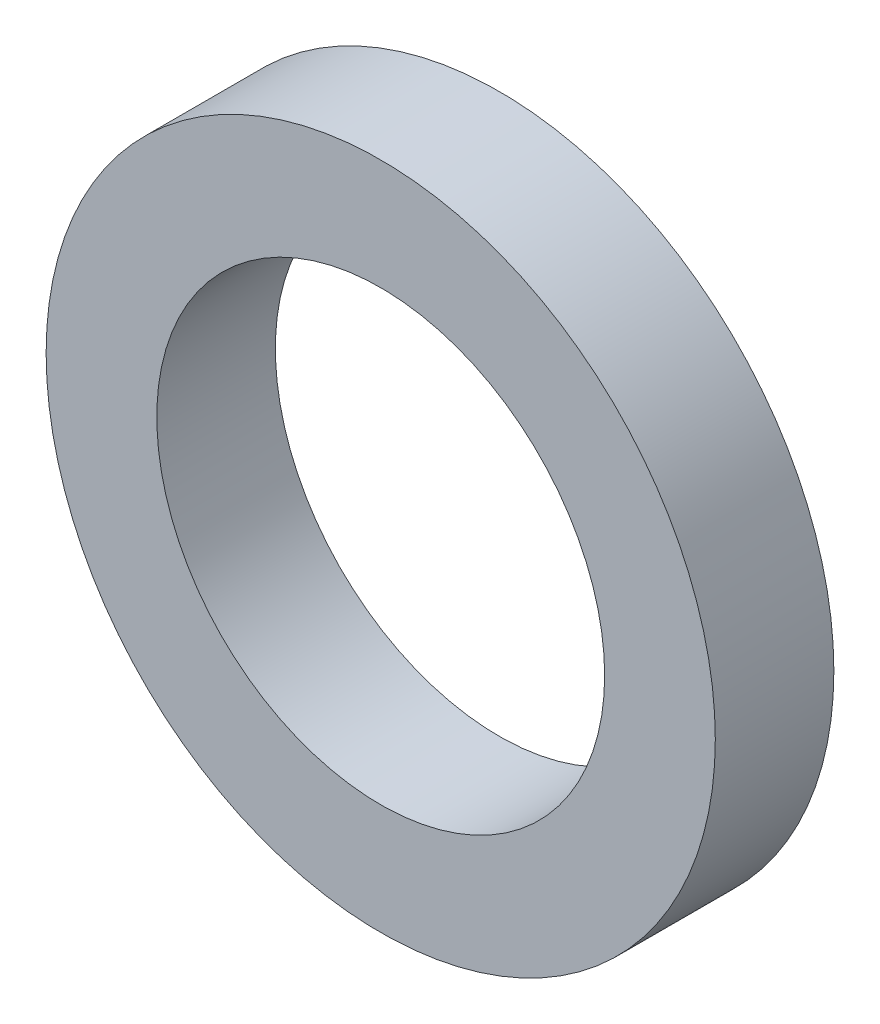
ISO-10303-21;
HEADER;
FILE_DESCRIPTION(('STEP AP214'),'2;1');
FILE_NAME('part.step','',(''),(''),'','','');
FILE_SCHEMA(('AUTOMOTIVE_DESIGN { 1 0 10303 214 1 1 1 1 }'));
ENDSEC;
DATA;
#1=APPLICATION_CONTEXT('core data for automotive mechanical design processes');
#2=APPLICATION_PROTOCOL_DEFINITION('international standard','automotive_design',2000,#1);
#3=PRODUCT_CONTEXT('',#1,'mechanical');
#4=PRODUCT('Part','Part','',(#3));
#5=PRODUCT_RELATED_PRODUCT_CATEGORY('part','',(#4));
#6=PRODUCT_DEFINITION_FORMATION('','',#4);
#7=PRODUCT_DEFINITION_CONTEXT('part definition',#1,'design');
#8=PRODUCT_DEFINITION('design','',#6,#7);
#9=PRODUCT_DEFINITION_SHAPE('','',#8);
#10=(LENGTH_UNIT() NAMED_UNIT(*) SI_UNIT(.MILLI.,.METRE.));
#11=(NAMED_UNIT(*) PLANE_ANGLE_UNIT() SI_UNIT($,.RADIAN.));
#12=(NAMED_UNIT(*) SI_UNIT($,.STERADIAN.) SOLID_ANGLE_UNIT());
#13=UNCERTAINTY_MEASURE_WITH_UNIT(LENGTH_MEASURE(1.E-05),#10,'distance_accuracy_value','');
#14=(GEOMETRIC_REPRESENTATION_CONTEXT(3) GLOBAL_UNCERTAINTY_ASSIGNED_CONTEXT((#13)) GLOBAL_UNIT_ASSIGNED_CONTEXT((#10,
#11,#12)) REPRESENTATION_CONTEXT('',''));
#15=CARTESIAN_POINT('',(0.,0.,0.));
#16=DIRECTION('',(0.,0.,1.));
#17=DIRECTION('',(1.,0.,0.));
#18=AXIS2_PLACEMENT_3D('',#15,#16,#17);
#19=CARTESIAN_POINT('',(0.,0.,4.5));
#20=DIRECTION('',(0.,0.,1.));
#21=DIRECTION('',(1.,0.,0.));
#22=AXIS2_PLACEMENT_3D('',#19,#20,#21);
#23=PLANE('',#22);
#24=CARTESIAN_POINT('',(0.,0.,4.5));
#25=DIRECTION('',(0.,0.,1.));
#26=DIRECTION('',(1.,0.,0.));
#27=AXIS2_PLACEMENT_3D('',#24,#25,#26);
#28=CIRCLE('',#27,12.7);
#29=CARTESIAN_POINT('',(12.7,0.,4.5));
#30=VERTEX_POINT('',#29);
#31=EDGE_CURVE('E10',#30,#30,#28,.T.);
#32=ORIENTED_EDGE('',*,*,#31,.T.);
#33=EDGE_LOOP('',(#32));
#34=FACE_BOUND('',#33,.T.);
#35=CARTESIAN_POINT('',(0.,0.,4.5));
#36=DIRECTION('',(0.,0.,1.));
#37=DIRECTION('',(1.,0.,0.));
#38=AXIS2_PLACEMENT_3D('',#35,#36,#37);
#39=CIRCLE('',#38,8.5);
#40=CARTESIAN_POINT('',(8.5,0.,4.5));
#41=VERTEX_POINT('',#40);
#42=EDGE_CURVE('E42',#41,#41,#39,.T.);
#43=ORIENTED_EDGE('',*,*,#42,.F.);
#44=EDGE_LOOP('',(#43));
#45=FACE_BOUND('',#44,.T.);
#46=ADVANCED_FACE('F31',(#34,#45),#23,.T.);
#47=CARTESIAN_POINT('',(0.,0.,0.));
#48=DIRECTION('',(0.,0.,1.));
#49=DIRECTION('',(1.,0.,0.));
#50=AXIS2_PLACEMENT_3D('',#47,#48,#49);
#51=PLANE('',#50);
#52=CARTESIAN_POINT('',(0.,0.,0.));
#53=DIRECTION('',(0.,0.,1.));
#54=DIRECTION('',(1.,0.,0.));
#55=AXIS2_PLACEMENT_3D('',#52,#53,#54);
#56=CIRCLE('',#55,12.7);
#57=CARTESIAN_POINT('',(12.7,0.,0.));
#58=VERTEX_POINT('',#57);
#59=EDGE_CURVE('E35',#58,#58,#56,.T.);
#60=ORIENTED_EDGE('',*,*,#59,.F.);
#61=EDGE_LOOP('',(#60));
#62=FACE_BOUND('',#61,.T.);
#63=CARTESIAN_POINT('',(0.,0.,0.));
#64=DIRECTION('',(0.,0.,1.));
#65=DIRECTION('',(1.,0.,0.));
#66=AXIS2_PLACEMENT_3D('',#63,#64,#65);
#67=CIRCLE('',#66,8.5);
#68=CARTESIAN_POINT('',(8.5,0.,0.));
#69=VERTEX_POINT('',#68);
#70=EDGE_CURVE('E44',#69,#69,#67,.T.);
#71=ORIENTED_EDGE('',*,*,#70,.T.);
#72=EDGE_LOOP('',(#71));
#73=FACE_BOUND('',#72,.T.);
#74=ADVANCED_FACE('F54',(#62,#73),#51,.F.);
#75=CARTESIAN_POINT('',(0.,0.,4.5));
#76=DIRECTION('',(0.,0.,-1.));
#77=DIRECTION('',(-1.,0.,0.));
#78=AXIS2_PLACEMENT_3D('',#75,#76,#77);
#79=CYLINDRICAL_SURFACE('',#78,12.7);
#80=ORIENTED_EDGE('',*,*,#31,.F.);
#81=EDGE_LOOP('',(#80));
#82=FACE_BOUND('',#81,.T.);
#83=ORIENTED_EDGE('',*,*,#59,.T.);
#84=EDGE_LOOP('',(#83));
#85=FACE_BOUND('',#84,.T.);
#86=ADVANCED_FACE('F33',(#82,#85),#79,.T.);
#87=CARTESIAN_POINT('',(0.,0.,4.5));
#88=DIRECTION('',(0.,0.,-1.));
#89=DIRECTION('',(-1.,0.,0.));
#90=AXIS2_PLACEMENT_3D('',#87,#88,#89);
#91=CYLINDRICAL_SURFACE('',#90,8.5);
#92=ORIENTED_EDGE('',*,*,#42,.T.);
#93=EDGE_LOOP('',(#92));
#94=FACE_BOUND('',#93,.T.);
#95=ORIENTED_EDGE('',*,*,#70,.F.);
#96=EDGE_LOOP('',(#95));
#97=FACE_BOUND('',#96,.T.);
#98=ADVANCED_FACE('F50',(#94,#97),#91,.F.);
#99=CLOSED_SHELL('',(#46,#74,#86,#98));
#100=MANIFOLD_SOLID_BREP('B2',#99);
#101=ADVANCED_BREP_SHAPE_REPRESENTATION('',(#18,#100),#14);
#102=SHAPE_DEFINITION_REPRESENTATION(#9,#101);
ENDSEC;
END-ISO-10303-21;
